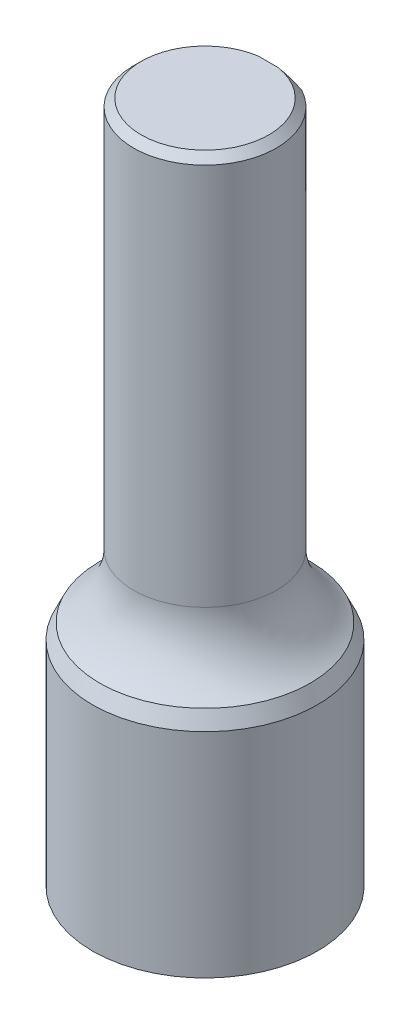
ISO-10303-21;
HEADER;
FILE_DESCRIPTION(('STEP AP214'),'2;1');
FILE_NAME('part.step','',(''),(''),'','','');
FILE_SCHEMA(('AUTOMOTIVE_DESIGN { 1 0 10303 214 1 1 1 1 }'));
ENDSEC;
DATA;
#1=APPLICATION_CONTEXT('core data for automotive mechanical design processes');
#2=APPLICATION_PROTOCOL_DEFINITION('international standard','automotive_design',2000,#1);
#3=PRODUCT_CONTEXT('',#1,'mechanical');
#4=PRODUCT('Part','Part','',(#3));
#5=PRODUCT_RELATED_PRODUCT_CATEGORY('part','',(#4));
#6=PRODUCT_DEFINITION_FORMATION('','',#4);
#7=PRODUCT_DEFINITION_CONTEXT('part definition',#1,'design');
#8=PRODUCT_DEFINITION('design','',#6,#7);
#9=PRODUCT_DEFINITION_SHAPE('','',#8);
#10=(LENGTH_UNIT() NAMED_UNIT(*) SI_UNIT(.MILLI.,.METRE.));
#11=(NAMED_UNIT(*) PLANE_ANGLE_UNIT() SI_UNIT($,.RADIAN.));
#12=(NAMED_UNIT(*) SI_UNIT($,.STERADIAN.) SOLID_ANGLE_UNIT());
#13=UNCERTAINTY_MEASURE_WITH_UNIT(LENGTH_MEASURE(1.E-05),#10,'distance_accuracy_value','');
#14=(GEOMETRIC_REPRESENTATION_CONTEXT(3) GLOBAL_UNCERTAINTY_ASSIGNED_CONTEXT((#13)) GLOBAL_UNIT_ASSIGNED_CONTEXT((#10,
#11,#12)) REPRESENTATION_CONTEXT('',''));
#15=CARTESIAN_POINT('',(0.,0.,0.));
#16=DIRECTION('',(0.,0.,1.));
#17=DIRECTION('',(1.,0.,0.));
#18=AXIS2_PLACEMENT_3D('',#15,#16,#17);
#19=CARTESIAN_POINT('',(0.,122.662819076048,0.));
#20=DIRECTION('',(0.,1.,0.));
#21=DIRECTION('',(0.,0.,1.));
#22=AXIS2_PLACEMENT_3D('',#19,#20,#21);
#23=CYLINDRICAL_SURFACE('',#22,7.50062);
#24=CARTESIAN_POINT('',(0.,14.2240000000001,0.));
#25=DIRECTION('',(0.,-1.,0.));
#26=DIRECTION('',(0.,0.,-1.));
#27=AXIS2_PLACEMENT_3D('',#24,#25,#26);
#28=CIRCLE('',#27,7.50062);
#29=CARTESIAN_POINT('',(0.,14.2240000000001,-7.50062));
#30=VERTEX_POINT('',#29);
#31=EDGE_CURVE('E73',#30,#30,#28,.T.);
#32=ORIENTED_EDGE('',*,*,#31,.T.);
#33=EDGE_LOOP('',(#32));
#34=FACE_BOUND('',#33,.T.);
#35=CARTESIAN_POINT('',(0.,0.,0.));
#36=DIRECTION('',(0.,1.,0.));
#37=DIRECTION('',(0.,0.,1.));
#38=AXIS2_PLACEMENT_3D('',#35,#36,#37);
#39=CIRCLE('',#38,7.50062);
#40=CARTESIAN_POINT('',(0.,0.,7.50062));
#41=VERTEX_POINT('',#40);
#42=EDGE_CURVE('E63',#41,#41,#39,.T.);
#43=ORIENTED_EDGE('',*,*,#42,.T.);
#44=EDGE_LOOP('',(#43));
#45=FACE_BOUND('',#44,.T.);
#46=ADVANCED_FACE('F17',(#34,#45),#23,.T.);
#47=CARTESIAN_POINT('',(0.,0.,-7.50062));
#48=DIRECTION('',(0.,1.,0.));
#49=DIRECTION('',(0.,0.,1.));
#50=AXIS2_PLACEMENT_3D('',#47,#48,#49);
#51=PLANE('',#50);
#52=ORIENTED_EDGE('',*,*,#42,.F.);
#53=EDGE_LOOP('',(#52));
#54=FACE_BOUND('',#53,.T.);
#55=ADVANCED_FACE('F96',(#54),#51,.F.);
#56=CARTESIAN_POINT('',(0.,45.5168,0.));
#57=DIRECTION('',(0.,-1.,0.));
#58=DIRECTION('',(0.,0.,-1.));
#59=AXIS2_PLACEMENT_3D('',#56,#57,#58);
#60=PLANE('',#59);
#61=CARTESIAN_POINT('',(0.,45.5168,0.));
#62=DIRECTION('',(0.,-1.,0.));
#63=DIRECTION('',(0.,0.,-1.));
#64=AXIS2_PLACEMENT_3D('',#61,#62,#63);
#65=CIRCLE('',#64,4.25450000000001);
#66=CARTESIAN_POINT('',(-0.655497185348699,45.5168,-4.2037));
#67=VERTEX_POINT('',#66);
#68=CARTESIAN_POINT('',(0.655497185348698,45.5168,-4.2037));
#69=VERTEX_POINT('',#68);
#70=EDGE_CURVE('E58',#67,#69,#65,.F.);
#71=ORIENTED_EDGE('',*,*,#70,.T.);
#72=DIRECTION('',(1.,0.,0.));
#73=VECTOR('',#72,1.);
#74=CARTESIAN_POINT('',(6.63212456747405,45.5168,-4.2037));
#75=LINE('',#74,#73);
#76=EDGE_CURVE('E32',#67,#69,#75,.T.);
#77=ORIENTED_EDGE('',*,*,#76,.F.);
#78=EDGE_LOOP('',(#71,#77));
#79=FACE_BOUND('',#78,.T.);
#80=ADVANCED_FACE('F57',(#79),#60,.F.);
#81=CARTESIAN_POINT('',(0.,122.662819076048,0.));
#82=DIRECTION('',(0.,1.,0.));
#83=DIRECTION('',(0.,0.,1.));
#84=AXIS2_PLACEMENT_3D('',#81,#82,#83);
#85=CYLINDRICAL_SURFACE('',#84,4.7625);
#86=CARTESIAN_POINT('',(0.,19.4683002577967,0.));
#87=DIRECTION('',(0.,-1.,0.));
#88=DIRECTION('',(0.,0.,-1.));
#89=AXIS2_PLACEMENT_3D('',#86,#87,#88);
#90=CIRCLE('',#89,4.7625);
#91=CARTESIAN_POINT('',(0.,19.4683002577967,-4.7625));
#92=VERTEX_POINT('',#91);
#93=EDGE_CURVE('E76',#92,#92,#90,.F.);
#94=ORIENTED_EDGE('',*,*,#93,.T.);
#95=EDGE_LOOP('',(#94));
#96=FACE_BOUND('',#95,.T.);
#97=CARTESIAN_POINT('',(0.,27.7368,0.));
#98=DIRECTION('',(0.,-1.,0.));
#99=DIRECTION('',(0.,0.,-1.));
#100=AXIS2_PLACEMENT_3D('',#97,#98,#99);
#101=CIRCLE('',#100,4.7625);
#102=CARTESIAN_POINT('',(-2.23837274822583,27.7368,-4.2037));
#103=VERTEX_POINT('',#102);
#104=CARTESIAN_POINT('',(2.23837274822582,27.7368,-4.2037));
#105=VERTEX_POINT('',#104);
#106=EDGE_CURVE('E11',#103,#105,#101,.T.);
#107=ORIENTED_EDGE('',*,*,#106,.T.);
#108=DIRECTION('',(0.,1.,0.));
#109=VECTOR('',#108,1.);
#110=CARTESIAN_POINT('',(2.23837274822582,122.662819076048,-4.2037));
#111=LINE('',#110,#109);
#112=CARTESIAN_POINT('',(2.23837274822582,45.0088,-4.2037));
#113=VERTEX_POINT('',#112);
#114=EDGE_CURVE('E119',#105,#113,#111,.T.);
#115=ORIENTED_EDGE('',*,*,#114,.T.);
#116=CARTESIAN_POINT('',(0.,45.0088,0.));
#117=DIRECTION('',(0.,-1.,0.));
#118=DIRECTION('',(0.,0.,-1.));
#119=AXIS2_PLACEMENT_3D('',#116,#117,#118);
#120=CIRCLE('',#119,4.7625);
#121=CARTESIAN_POINT('',(-2.23837274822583,45.0088,-4.2037));
#122=VERTEX_POINT('',#121);
#123=EDGE_CURVE('E62',#113,#122,#120,.T.);
#124=ORIENTED_EDGE('',*,*,#123,.T.);
#125=DIRECTION('',(0.,1.,0.));
#126=VECTOR('',#125,1.);
#127=CARTESIAN_POINT('',(-2.23837274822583,122.662819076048,-4.2037));
#128=LINE('',#127,#126);
#129=EDGE_CURVE('E38',#122,#103,#128,.F.);
#130=ORIENTED_EDGE('',*,*,#129,.T.);
#131=EDGE_LOOP('',(#107,#115,#124,#130));
#132=FACE_BOUND('',#131,.T.);
#133=ADVANCED_FACE('F90',(#96,#132),#85,.T.);
#134=CARTESIAN_POINT('',(0.,45.5168,0.));
#135=DIRECTION('',(0.,-1.,0.));
#136=DIRECTION('',(0.,0.,-1.));
#137=AXIS2_PLACEMENT_3D('',#134,#135,#136);
#138=CONICAL_SURFACE('',#137,4.25450000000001,0.785398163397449);
#139=CARTESIAN_POINT('',(-9.6063194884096,39.2854777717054,-4.2037));
#140=CARTESIAN_POINT('',(-9.46476418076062,39.4151576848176,-4.2037));
#141=CARTESIAN_POINT('',(-9.32298209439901,39.5445899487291,-4.2037));
#142=CARTESIAN_POINT('',(-9.03889879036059,39.8028857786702,-4.2037));
#143=CARTESIAN_POINT('',(-8.89659756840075,39.9317493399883,-4.2037));
#144=CARTESIAN_POINT('',(-8.46875352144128,40.3174339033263,-4.2037));
#145=CARTESIAN_POINT('',(-8.1823366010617,40.573287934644,-4.2037));
#146=CARTESIAN_POINT('',(-7.60456218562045,41.0832687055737,-4.2037));
#147=CARTESIAN_POINT('',(-7.31318449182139,41.3373725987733,-4.2037));
#148=CARTESIAN_POINT('',(-6.72638714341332,41.8408164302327,-4.2037));
#149=CARTESIAN_POINT('',(-6.43096800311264,42.0901569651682,-4.2037));
#150=CARTESIAN_POINT('',(-5.88426529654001,42.5410870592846,-4.2037));
#151=CARTESIAN_POINT('',(-5.63383398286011,42.7437076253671,-4.2037));
#152=CARTESIAN_POINT('',(-5.12775680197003,43.1425308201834,-4.2037));
#153=CARTESIAN_POINT('',(-4.87210954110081,43.3387316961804,-4.2037));
#154=CARTESIAN_POINT('',(-4.48358857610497,43.6258842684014,-4.2037));
#155=CARTESIAN_POINT('',(-4.35331800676,43.7203568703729,-4.2037));
#156=CARTESIAN_POINT('',(-4.09074588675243,43.9064305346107,-4.2037));
#157=CARTESIAN_POINT('',(-3.95844444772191,43.9980317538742,-4.2037));
#158=CARTESIAN_POINT('',(-3.69151943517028,44.1776723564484,-4.2037));
#159=CARTESIAN_POINT('',(-3.55689688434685,44.2657132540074,-4.2037));
#160=CARTESIAN_POINT('',(-3.28488969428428,44.4374025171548,-4.2037));
#161=CARTESIAN_POINT('',(-3.14750540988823,44.5210514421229,-4.2037));
#162=CARTESIAN_POINT('',(-2.87167681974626,44.6815811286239,-4.2037));
#163=CARTESIAN_POINT('',(-2.73328235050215,44.7585470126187,-4.2037));
#164=CARTESIAN_POINT('',(-2.45291003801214,44.9057451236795,-4.2037));
#165=CARTESIAN_POINT('',(-2.31093183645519,44.9759766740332,-4.2037));
#166=CARTESIAN_POINT('',(-2.02320517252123,45.1078116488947,-4.2037));
#167=CARTESIAN_POINT('',(-1.87746174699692,45.1694259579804,-4.2037));
#168=CARTESIAN_POINT('',(-1.5818589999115,45.2818993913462,-4.2037));
#169=CARTESIAN_POINT('',(-1.43200086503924,45.3327615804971,-4.2037));
#170=CARTESIAN_POINT('',(-1.15902360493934,45.4122864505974,-4.2037));
#171=CARTESIAN_POINT('',(-1.0366102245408,45.4433576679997,-4.2037));
#172=CARTESIAN_POINT('',(-0.789702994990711,45.4957665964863,-4.2037));
#173=CARTESIAN_POINT('',(-0.66520943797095,45.5171056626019,-4.2037));
#174=CARTESIAN_POINT('',(-0.41514676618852,45.5489653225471,-4.2037));
#175=CARTESIAN_POINT('',(-0.289581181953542,45.5595132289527,-4.2037));
#176=CARTESIAN_POINT('',(-0.038004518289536,45.5693071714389,-4.2037));
#177=CARTESIAN_POINT('',(0.0880065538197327,45.5685533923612,-4.2037));
#178=CARTESIAN_POINT('',(0.339391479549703,45.5557900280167,-4.2037));
#179=CARTESIAN_POINT('',(0.464765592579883,45.5437854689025,-4.2037));
#180=CARTESIAN_POINT('',(0.714030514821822,45.5091776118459,-4.2037));
#181=CARTESIAN_POINT('',(0.837921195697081,45.4865734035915,-4.2037));
#182=CARTESIAN_POINT('',(1.08391189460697,45.431769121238,-4.2037));
#183=CARTESIAN_POINT('',(1.20600565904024,45.3995413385,-4.2037));
#184=CARTESIAN_POINT('',(1.44766693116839,45.3268036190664,-4.2037));
#185=CARTESIAN_POINT('',(1.5672344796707,45.286293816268,-4.2037));
#186=CARTESIAN_POINT('',(1.83374723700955,45.1871126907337,-4.2037));
#187=CARTESIAN_POINT('',(1.97994398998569,45.126441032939,-4.2037));
#188=CARTESIAN_POINT('',(2.26841975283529,44.9963410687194,-4.2037));
#189=CARTESIAN_POINT('',(2.41069678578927,44.9269084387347,-4.2037));
#190=CARTESIAN_POINT('',(2.69189036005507,44.7810197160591,-4.2037));
#191=CARTESIAN_POINT('',(2.83080061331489,44.704551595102,-4.2037));
#192=CARTESIAN_POINT('',(3.10546998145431,44.5461251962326,-4.2037));
#193=CARTESIAN_POINT('',(3.2412284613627,44.4641658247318,-4.2037));
#194=CARTESIAN_POINT('',(3.51140428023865,44.2950013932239,-4.2037));
#195=CARTESIAN_POINT('',(3.64579275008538,44.2077504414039,-4.2037));
#196=CARTESIAN_POINT('',(3.91217832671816,44.0296604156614,-4.2037));
#197=CARTESIAN_POINT('',(4.04417522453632,43.9388210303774,-4.2037));
#198=CARTESIAN_POINT('',(4.30615348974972,43.7542066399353,-4.2037));
#199=CARTESIAN_POINT('',(4.43613423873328,43.6604307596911,-4.2037));
#200=CARTESIAN_POINT('',(4.69433739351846,43.470485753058,-4.2037));
#201=CARTESIAN_POINT('',(4.82255973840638,43.374316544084,-4.2037));
#202=CARTESIAN_POINT('',(5.15745819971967,43.119052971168,-4.2037));
#203=CARTESIAN_POINT('',(5.36289171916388,42.9583290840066,-4.2037));
#204=CARTESIAN_POINT('',(5.77056964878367,42.6329865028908,-4.2037));
#205=CARTESIAN_POINT('',(5.9728146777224,42.468368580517,-4.2037));
#206=CARTESIAN_POINT('',(6.37492862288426,42.1359872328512,-4.2037));
#207=CARTESIAN_POINT('',(6.57479584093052,41.9682217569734,-4.2037));
#208=CARTESIAN_POINT('',(6.97250721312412,41.630294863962,-4.2037));
#209=CARTESIAN_POINT('',(7.17035126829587,41.4601333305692,-4.2037));
#210=CARTESIAN_POINT('',(7.5565054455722,41.124734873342,-4.2037));
#211=CARTESIAN_POINT('',(7.74488067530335,40.9595728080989,-4.2037));
#212=CARTESIAN_POINT('',(8.12035088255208,40.6278065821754,-4.2037));
#213=CARTESIAN_POINT('',(8.30744587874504,40.4612024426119,-4.2037));
#214=CARTESIAN_POINT('',(8.68035700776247,40.1269832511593,-4.2037));
#215=CARTESIAN_POINT('',(8.86617432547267,39.959369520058,-4.2037));
#216=CARTESIAN_POINT('',(9.23689404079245,39.6231338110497,-4.2037));
#217=CARTESIAN_POINT('',(9.42179644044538,39.4545118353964,-4.2037));
#218=CARTESIAN_POINT('',(9.6063194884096,39.2854777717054,-4.2037));
#219=B_SPLINE_CURVE_WITH_KNOTS('',3,(#139,#140,#141,#142,#143,#144,#145,#146,#147,#148,#149,
#150,#151,#152,#153,#154,#155,#156,#157,#158,#159,#160,#161,#162,#163,#164,#165,#166,#167,#168,
#169,#170,#171,#172,#173,#174,#175,#176,#177,#178,#179,#180,#181,#182,#183,#184,#185,#186,#187,
#188,#189,#190,#191,#192,#193,#194,#195,#196,#197,#198,#199,#200,#201,#202,#203,#204,#205,#206,
#207,#208,#209,#210,#211,#212,#213,#214,#215,#216,#217,#218),.UNSPECIFIED.,.F.,.F.,(4,2,2,2,2,2,
2,2,2,2,2,2,2,2,2,2,2,2,2,2,2,2,2,2,2,2,2,2,2,2,2,2,2,2,2,2,2,2,2,4),(0.,0.575927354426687,
1.15185947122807,2.30399363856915,3.46379969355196,4.62345950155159,5.58979798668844,
6.55639814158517,7.03913073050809,7.52183687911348,8.00433552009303,8.48677255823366,
8.96169564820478,9.43666641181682,9.91103170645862,10.3852616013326,10.7638064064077,
11.1422984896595,11.5198302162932,11.8973557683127,12.2747127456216,12.6521021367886,
13.0305887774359,13.409069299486,13.8835516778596,14.3582691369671,14.8338138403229,
15.3094535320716,15.7900669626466,16.2707221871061,16.7515220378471,17.2323385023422,
18.0147739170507,18.7970555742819,19.5798659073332,20.3627143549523,21.1142863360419,
21.8658473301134,22.6165776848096,23.3673063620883),.UNSPECIFIED.);
#220=EDGE_CURVE('E25',#122,#67,#219,.T.);
#221=ORIENTED_EDGE('',*,*,#220,.F.);
#222=ORIENTED_EDGE('',*,*,#123,.F.);
#223=EDGE_CURVE('E54',#69,#113,#219,.T.);
#224=ORIENTED_EDGE('',*,*,#223,.F.);
#225=ORIENTED_EDGE('',*,*,#70,.F.);
#226=EDGE_LOOP('',(#221,#222,#224,#225));
#227=FACE_BOUND('',#226,.T.);
#228=ADVANCED_FACE('F61',(#227),#138,.T.);
#229=CARTESIAN_POINT('',(0.,15.24,0.));
#230=DIRECTION('',(0.,-1.,0.));
#231=DIRECTION('',(0.,0.,-1.));
#232=AXIS2_PLACEMENT_3D('',#229,#230,#231);
#233=CONICAL_SURFACE('',#232,7.02685141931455,0.43633231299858);
#234=ORIENTED_EDGE('',*,*,#31,.F.);
#235=EDGE_LOOP('',(#234));
#236=FACE_BOUND('',#235,.T.);
#237=CARTESIAN_POINT('',(0.,15.24,0.));
#238=DIRECTION('',(0.,-1.,0.));
#239=DIRECTION('',(0.,0.,-1.));
#240=AXIS2_PLACEMENT_3D('',#237,#238,#239);
#241=CIRCLE('',#240,7.02685141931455);
#242=CARTESIAN_POINT('',(0.,15.24,-7.02685141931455));
#243=VERTEX_POINT('',#242);
#244=EDGE_CURVE('E65',#243,#243,#241,.F.);
#245=ORIENTED_EDGE('',*,*,#244,.F.);
#246=EDGE_LOOP('',(#245));
#247=FACE_BOUND('',#246,.T.);
#248=ADVANCED_FACE('F109',(#236,#247),#233,.T.);
#249=CARTESIAN_POINT('',(0.,19.4683002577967,0.));
#250=DIRECTION('',(0.,-1.,0.));
#251=DIRECTION('',(0.,0.,-1.));
#252=AXIS2_PLACEMENT_3D('',#249,#250,#251);
#253=TOROIDAL_SURFACE('',#252,9.8425,5.08);
#254=ORIENTED_EDGE('',*,*,#244,.T.);
#255=EDGE_LOOP('',(#254));
#256=FACE_BOUND('',#255,.T.);
#257=ORIENTED_EDGE('',*,*,#93,.F.);
#258=EDGE_LOOP('',(#257));
#259=FACE_BOUND('',#258,.T.);
#260=ADVANCED_FACE('F19',(#256,#259),#253,.F.);
#261=CARTESIAN_POINT('',(6.63212456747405,27.7368,-4.2037));
#262=DIRECTION('',(0.,-1.,0.));
#263=DIRECTION('',(0.,0.,-1.));
#264=AXIS2_PLACEMENT_3D('',#261,#262,#263);
#265=PLANE('',#264);
#266=DIRECTION('',(1.,0.,0.));
#267=VECTOR('',#266,1.);
#268=CARTESIAN_POINT('',(6.63212456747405,27.7368,-4.2037));
#269=LINE('',#268,#267);
#270=EDGE_CURVE('E59',#103,#105,#269,.T.);
#271=ORIENTED_EDGE('',*,*,#270,.T.);
#272=ORIENTED_EDGE('',*,*,#106,.F.);
#273=EDGE_LOOP('',(#271,#272));
#274=FACE_BOUND('',#273,.T.);
#275=ADVANCED_FACE('F89',(#274),#265,.F.);
#276=CARTESIAN_POINT('',(6.63212456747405,27.7368,-4.2037));
#277=DIRECTION('',(0.,0.,1.));
#278=DIRECTION('',(1.,0.,0.));
#279=AXIS2_PLACEMENT_3D('',#276,#277,#278);
#280=PLANE('',#279);
#281=ORIENTED_EDGE('',*,*,#220,.T.);
#282=ORIENTED_EDGE('',*,*,#76,.T.);
#283=ORIENTED_EDGE('',*,*,#223,.T.);
#284=ORIENTED_EDGE('',*,*,#114,.F.);
#285=ORIENTED_EDGE('',*,*,#270,.F.);
#286=ORIENTED_EDGE('',*,*,#129,.F.);
#287=EDGE_LOOP('',(#281,#282,#283,#284,#285,#286));
#288=FACE_BOUND('',#287,.T.);
#289=ADVANCED_FACE('F49',(#288),#280,.F.);
#290=CLOSED_SHELL('',(#46,#55,#80,#133,#228,#248,#260,#275,#289));
#291=MANIFOLD_SOLID_BREP('B1',#290);
#292=ADVANCED_BREP_SHAPE_REPRESENTATION('',(#18,#291),#14);
#293=SHAPE_DEFINITION_REPRESENTATION(#9,#292);
ENDSEC;
END-ISO-10303-21;
